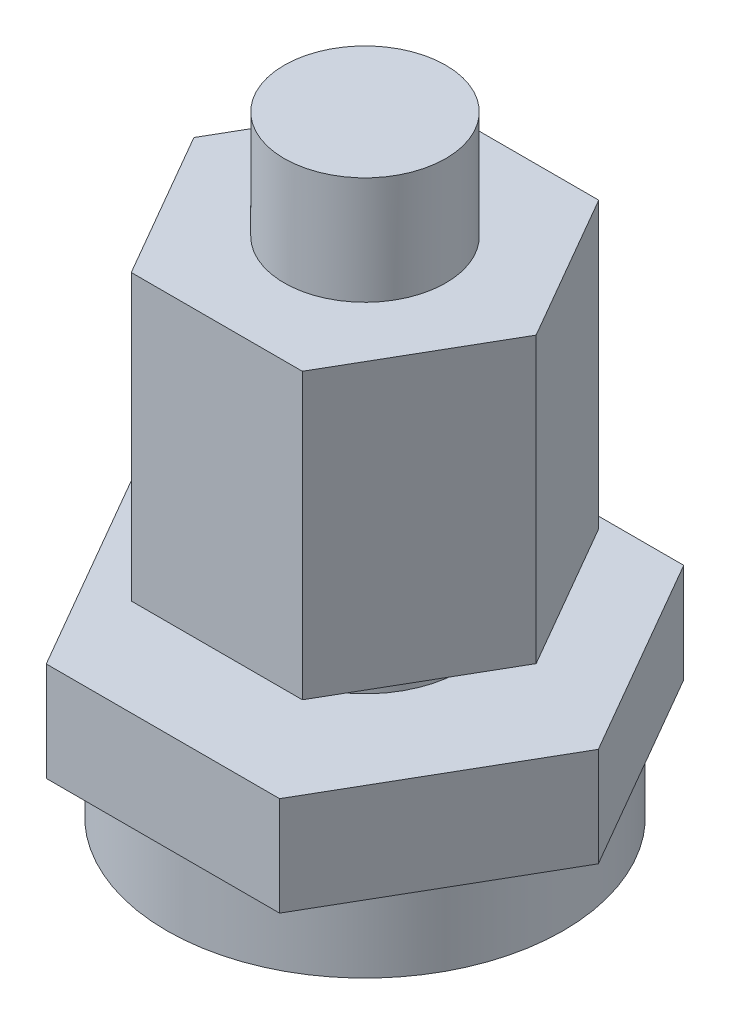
from build123d import *

# Parameters (mm, degrees)
SKETCH1_R      = 11.684
EXTRUDE1_DEPTH = 4.445
EXTRUDE2_DEPTH = 5.842
SKETCH3_R      = 5.715
EXTRUDE3_DEPTH = 2.54
EXTRUDE4_DEPTH = 16.764
SKETCH5_R      = 4.7625
EXTRUDE5_DEPTH = 6.35


with BuildPart() as part:
    # Sketch1 → Extrude1 (new body)
    with BuildSketch(Plane(origin=(0, 0, 0), x_dir=(1, 0, 0), z_dir=(0, 1, 0))):
        with Locations(Location((0, 0, 0), (0, 0, 270))):
            Circle(SKETCH1_R)
    extrude(amount=EXTRUDE1_DEPTH)

    # Sketch2 → Extrude2 (add)
    with BuildSketch(Plane(origin=(0, 4.445, 0), x_dir=(1, 0, 0), z_dir=(0, 1, 0))):
        Polygon((-6.874076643, -11.90625), (6.874076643, -11.90625), (13.748153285, 0), (6.874076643, 11.90625), (-6.874076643, 11.90625), (-13.748153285, 0), align=None)
    extrude(amount=EXTRUDE2_DEPTH)

    # Sketch3 → Extrude3 (add)
    with BuildSketch(Plane(origin=(0, 10.287, 0), x_dir=(1, 0, 0), z_dir=(0, 1, 0))):
        with Locations(Location((0, 0, 0), (0, 0, 270))):
            Circle(SKETCH3_R)
    extrude(amount=EXTRUDE3_DEPTH)

    # Sketch4 → Extrude4 (add)
    with BuildSketch(Plane(origin=(0, 12.827, 0), x_dir=(1, 0, 0), z_dir=(0, 1, 0))):
        Polygon((-5.040989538, -8.73125), (5.040989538, -8.73125), (10.081979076, 0), (5.040989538, 8.73125), (-5.040989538, 8.73125), (-10.081979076, 0), align=None)
    extrude(amount=EXTRUDE4_DEPTH)

    # Sketch5 → Extrude5 (add)
    with BuildSketch(Plane(origin=(0, 29.591, 0), x_dir=(1, 0, 0), z_dir=(0, 1, 0))):
        with Locations(Location((0, 0, 0), (0, 0, 90))):
            Circle(SKETCH5_R)
    extrude(amount=EXTRUDE5_DEPTH)


solid = part.part
